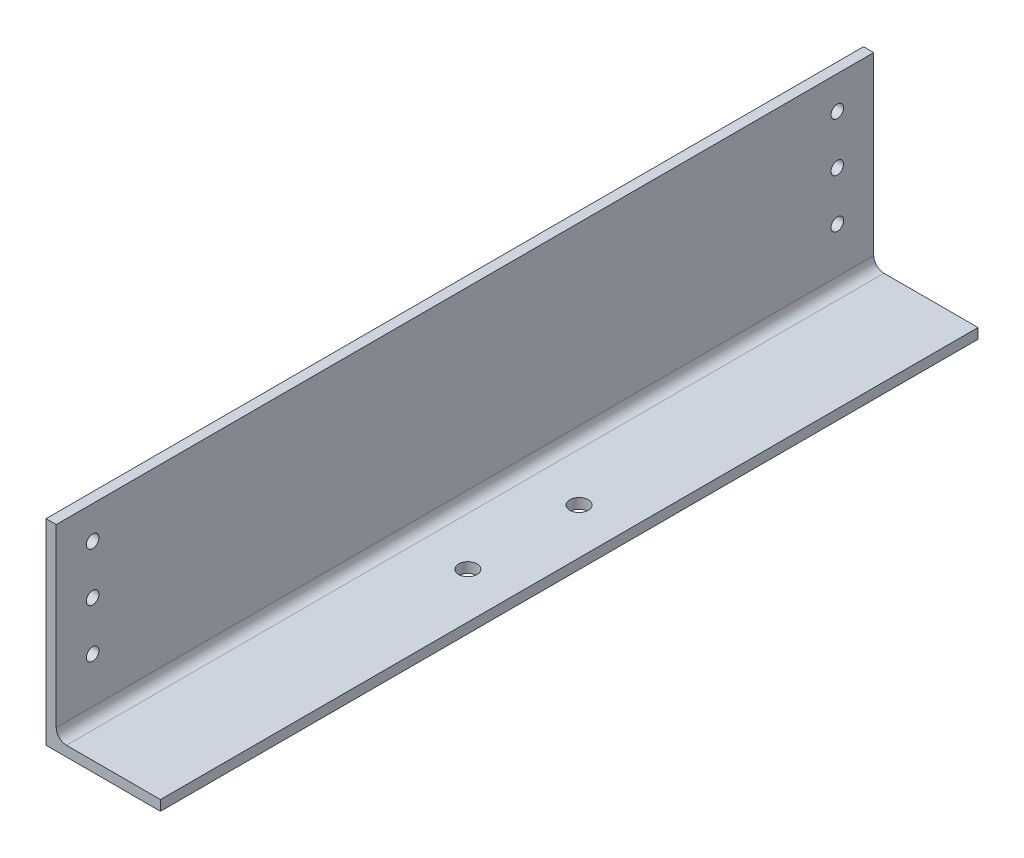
from build123d import *

# Parameters (mm, degrees)
BOSS_EXTRUDE1_DEPTH = 317.5
SKETCH2_R           = 4.9022
CUT_EXTRUDE1_DEPTH  = 341.534296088
SKETCH3_R           = 7.14375
CUT_EXTRUDE2_DEPTH  = 341.534296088


with BuildPart() as part:
    # sk LS6x3.5x0.312 → Boss-Extrude1 (new, symmetric)
    with BuildSketch(Plane.XY):
        with BuildLine():
            Line((-19.315301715, -50.835603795), (-19.315301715, 101.564396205))
            Line((-19.315301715, 101.564396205), (-11.390501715, 101.564396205))
            Line((-11.390501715, 101.564396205), (-11.390501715, -34.986003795))
            ThreePointArc((-11.390501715, -34.986003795), (-9.069381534, -40.589683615), (-3.465701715, -42.910803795))
            Line((-3.465701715, -42.910803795), (69.584698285, -42.910803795))
            Line((69.584698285, -42.910803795), (69.584698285, -50.835603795))
            Line((69.584698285, -50.835603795), (-19.315301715, -50.835603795))
        make_face()
    extrude(amount=BOSS_EXTRUDE1_DEPTH, both=True)

    # Sketch2 → Cut-Extrude1 (cut, through all)
    with BuildSketch(Plane(origin=(0, 0, 0), x_dir=(0, 0, -1), z_dir=(1, 0, 0))):
        with Locations((-289.199113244, 76.164396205)):
            Circle(SKETCH2_R)
        with Locations((-289.199113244, 38.264922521)):
            Circle(SKETCH2_R)
        with Locations((-289.199113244, 0.365448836)):
            Circle(SKETCH2_R)
        with Locations((289.199113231, 76.164396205)):
            Circle(SKETCH2_R)
        with Locations((289.199113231, 38.264922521)):
            Circle(SKETCH2_R)
        with Locations((289.199113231, 0.365448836)):
            Circle(SKETCH2_R)
    extrude(amount=-CUT_EXTRUDE1_DEPTH, mode=Mode.SUBTRACT)

    # Sketch3 → Cut-Extrude2 (cut, through all)
    with BuildSketch(Plane(origin=(0, 0, 0), x_dir=(1, 0, 0), z_dir=(0, 1, 0))):
        with Locations(Location((34.024698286, 43.18, 0), (0, 0, 270))):
            Circle(SKETCH3_R)
        with Locations(Location((34.024698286, -43.18, 0), (0, 0, 270))):
            Circle(SKETCH3_R)
    extrude(amount=-CUT_EXTRUDE2_DEPTH, mode=Mode.SUBTRACT)


solid = part.part
